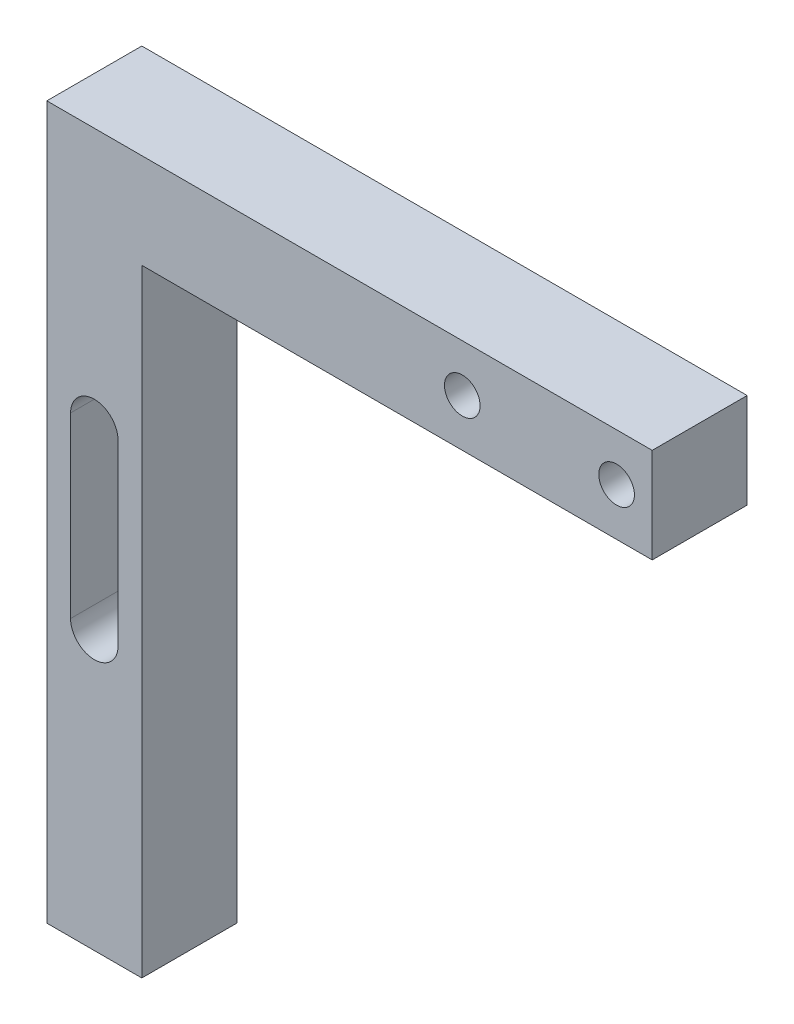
ISO-10303-21;
HEADER;
FILE_DESCRIPTION(('STEP AP214'),'2;1');
FILE_NAME('part.step','',(''),(''),'','','');
FILE_SCHEMA(('AUTOMOTIVE_DESIGN { 1 0 10303 214 1 1 1 1 }'));
ENDSEC;
DATA;
#1=APPLICATION_CONTEXT('core data for automotive mechanical design processes');
#2=APPLICATION_PROTOCOL_DEFINITION('international standard','automotive_design',2000,#1);
#3=PRODUCT_CONTEXT('',#1,'mechanical');
#4=PRODUCT('Part','Part','',(#3));
#5=PRODUCT_RELATED_PRODUCT_CATEGORY('part','',(#4));
#6=PRODUCT_DEFINITION_FORMATION('','',#4);
#7=PRODUCT_DEFINITION_CONTEXT('part definition',#1,'design');
#8=PRODUCT_DEFINITION('design','',#6,#7);
#9=PRODUCT_DEFINITION_SHAPE('','',#8);
#10=(LENGTH_UNIT() NAMED_UNIT(*) SI_UNIT(.MILLI.,.METRE.));
#11=(NAMED_UNIT(*) PLANE_ANGLE_UNIT() SI_UNIT($,.RADIAN.));
#12=(NAMED_UNIT(*) SI_UNIT($,.STERADIAN.) SOLID_ANGLE_UNIT());
#13=UNCERTAINTY_MEASURE_WITH_UNIT(LENGTH_MEASURE(1.E-05),#10,'distance_accuracy_value','');
#14=(GEOMETRIC_REPRESENTATION_CONTEXT(3) GLOBAL_UNCERTAINTY_ASSIGNED_CONTEXT((#13)) GLOBAL_UNIT_ASSIGNED_CONTEXT((#10,
#11,#12)) REPRESENTATION_CONTEXT('',''));
#15=CARTESIAN_POINT('',(0.,0.,0.));
#16=DIRECTION('',(0.,0.,1.));
#17=DIRECTION('',(1.,0.,0.));
#18=AXIS2_PLACEMENT_3D('',#15,#16,#17);
#19=CARTESIAN_POINT('',(0.,0.,8.));
#20=DIRECTION('',(0.,0.,-1.));
#21=DIRECTION('',(-1.,0.,0.));
#22=AXIS2_PLACEMENT_3D('',#19,#20,#21);
#23=PLANE('',#22);
#24=CARTESIAN_POINT('',(35.,-4.,8.));
#25=DIRECTION('',(0.,0.,1.));
#26=DIRECTION('',(1.,0.,0.));
#27=AXIS2_PLACEMENT_3D('',#24,#25,#26);
#28=CIRCLE('',#27,1.5);
#29=CARTESIAN_POINT('',(36.5,-4.,8.));
#30=VERTEX_POINT('',#29);
#31=EDGE_CURVE('E149',#30,#30,#28,.T.);
#32=ORIENTED_EDGE('',*,*,#31,.F.);
#33=EDGE_LOOP('',(#32));
#34=FACE_BOUND('',#33,.T.);
#35=CARTESIAN_POINT('',(48.,-4.,8.));
#36=DIRECTION('',(0.,0.,1.));
#37=DIRECTION('',(1.,0.,0.));
#38=AXIS2_PLACEMENT_3D('',#35,#36,#37);
#39=CIRCLE('',#38,1.5);
#40=CARTESIAN_POINT('',(49.5,-4.,8.));
#41=VERTEX_POINT('',#40);
#42=EDGE_CURVE('E155',#41,#41,#39,.T.);
#43=ORIENTED_EDGE('',*,*,#42,.F.);
#44=EDGE_LOOP('',(#43));
#45=FACE_BOUND('',#44,.T.);
#46=DIRECTION('',(0.,-1.,0.));
#47=VECTOR('',#46,1.);
#48=CARTESIAN_POINT('',(0.,-60.,8.));
#49=LINE('',#48,#47);
#50=CARTESIAN_POINT('',(0.,0.,8.));
#51=VERTEX_POINT('',#50);
#52=CARTESIAN_POINT('',(0.,-60.,8.));
#53=VERTEX_POINT('',#52);
#54=EDGE_CURVE('E161',#51,#53,#49,.T.);
#55=ORIENTED_EDGE('',*,*,#54,.T.);
#56=DIRECTION('',(1.,0.,0.));
#57=VECTOR('',#56,1.);
#58=CARTESIAN_POINT('',(8.00000000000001,-60.,8.));
#59=LINE('',#58,#57);
#60=CARTESIAN_POINT('',(8.00000000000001,-60.,8.));
#61=VERTEX_POINT('',#60);
#62=EDGE_CURVE('E164',#53,#61,#59,.T.);
#63=ORIENTED_EDGE('',*,*,#62,.T.);
#64=DIRECTION('',(0.,1.,0.));
#65=VECTOR('',#64,1.);
#66=CARTESIAN_POINT('',(8.,-8.00000000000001,8.));
#67=LINE('',#66,#65);
#68=CARTESIAN_POINT('',(8.,-8.00000000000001,8.));
#69=VERTEX_POINT('',#68);
#70=EDGE_CURVE('E167',#61,#69,#67,.T.);
#71=ORIENTED_EDGE('',*,*,#70,.T.);
#72=DIRECTION('',(1.,0.,0.));
#73=VECTOR('',#72,1.);
#74=CARTESIAN_POINT('',(51.,-8.00000000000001,8.));
#75=LINE('',#74,#73);
#76=CARTESIAN_POINT('',(51.,-8.00000000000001,8.));
#77=VERTEX_POINT('',#76);
#78=EDGE_CURVE('E169',#69,#77,#75,.T.);
#79=ORIENTED_EDGE('',*,*,#78,.T.);
#80=DIRECTION('',(0.,1.,0.));
#81=VECTOR('',#80,1.);
#82=CARTESIAN_POINT('',(51.,0.,8.));
#83=LINE('',#82,#81);
#84=CARTESIAN_POINT('',(51.,0.,8.));
#85=VERTEX_POINT('',#84);
#86=EDGE_CURVE('E171',#77,#85,#83,.T.);
#87=ORIENTED_EDGE('',*,*,#86,.T.);
#88=DIRECTION('',(-1.,0.,0.));
#89=VECTOR('',#88,1.);
#90=CARTESIAN_POINT('',(0.,0.,8.));
#91=LINE('',#90,#89);
#92=EDGE_CURVE('E173',#85,#51,#91,.T.);
#93=ORIENTED_EDGE('',*,*,#92,.T.);
#94=EDGE_LOOP('',(#55,#63,#71,#79,#87,#93));
#95=FACE_BOUND('',#94,.T.);
#96=CARTESIAN_POINT('',(4.,-21.7713426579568,8.));
#97=DIRECTION('',(0.,0.,1.));
#98=DIRECTION('',(1.,0.,0.));
#99=AXIS2_PLACEMENT_3D('',#96,#97,#98);
#100=CIRCLE('',#99,2.00000000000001);
#101=CARTESIAN_POINT('',(6.,-21.7713426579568,8.));
#102=VERTEX_POINT('',#101);
#103=CARTESIAN_POINT('',(1.99999999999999,-21.7713426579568,8.));
#104=VERTEX_POINT('',#103);
#105=EDGE_CURVE('E111',#102,#104,#100,.T.);
#106=ORIENTED_EDGE('',*,*,#105,.F.);
#107=DIRECTION('',(0.,1.,0.));
#108=VECTOR('',#107,1.);
#109=CARTESIAN_POINT('',(6.,-21.7713426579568,8.));
#110=LINE('',#109,#108);
#111=CARTESIAN_POINT('',(6.00000000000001,-36.7713426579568,8.));
#112=VERTEX_POINT('',#111);
#113=EDGE_CURVE('E133',#112,#102,#110,.T.);
#114=ORIENTED_EDGE('',*,*,#113,.F.);
#115=CARTESIAN_POINT('',(4.,-36.7713426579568,8.));
#116=DIRECTION('',(0.,0.,1.));
#117=DIRECTION('',(1.,0.,0.));
#118=AXIS2_PLACEMENT_3D('',#115,#116,#117);
#119=CIRCLE('',#118,2.00000000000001);
#120=CARTESIAN_POINT('',(2.,-36.7713426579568,8.));
#121=VERTEX_POINT('',#120);
#122=EDGE_CURVE('E131',#121,#112,#119,.T.);
#123=ORIENTED_EDGE('',*,*,#122,.F.);
#124=DIRECTION('',(0.,-1.,0.));
#125=VECTOR('',#124,1.);
#126=CARTESIAN_POINT('',(1.99999999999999,-21.7713426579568,8.));
#127=LINE('',#126,#125);
#128=EDGE_CURVE('E119',#104,#121,#127,.T.);
#129=ORIENTED_EDGE('',*,*,#128,.F.);
#130=EDGE_LOOP('',(#106,#114,#123,#129));
#131=FACE_BOUND('',#130,.T.);
#132=ADVANCED_FACE('F34',(#34,#45,#95,#131),#23,.F.);
#133=CARTESIAN_POINT('',(0.,0.,0.));
#134=DIRECTION('',(0.,0.,-1.));
#135=DIRECTION('',(-1.,0.,0.));
#136=AXIS2_PLACEMENT_3D('',#133,#134,#135);
#137=PLANE('',#136);
#138=CARTESIAN_POINT('',(48.,-4.,0.));
#139=DIRECTION('',(0.,0.,1.));
#140=DIRECTION('',(1.,0.,0.));
#141=AXIS2_PLACEMENT_3D('',#138,#139,#140);
#142=CIRCLE('',#141,1.5);
#143=CARTESIAN_POINT('',(49.5,-4.,0.));
#144=VERTEX_POINT('',#143);
#145=EDGE_CURVE('E152',#144,#144,#142,.T.);
#146=ORIENTED_EDGE('',*,*,#145,.T.);
#147=EDGE_LOOP('',(#146));
#148=FACE_BOUND('',#147,.T.);
#149=DIRECTION('',(0.,-1.,0.));
#150=VECTOR('',#149,1.);
#151=CARTESIAN_POINT('',(0.,-60.,0.));
#152=LINE('',#151,#150);
#153=CARTESIAN_POINT('',(0.,0.,0.));
#154=VERTEX_POINT('',#153);
#155=CARTESIAN_POINT('',(0.,-60.,0.));
#156=VERTEX_POINT('',#155);
#157=EDGE_CURVE('E158',#154,#156,#152,.T.);
#158=ORIENTED_EDGE('',*,*,#157,.F.);
#159=DIRECTION('',(-1.,0.,0.));
#160=VECTOR('',#159,1.);
#161=CARTESIAN_POINT('',(0.,0.,0.));
#162=LINE('',#161,#160);
#163=CARTESIAN_POINT('',(51.,0.,0.));
#164=VERTEX_POINT('',#163);
#165=EDGE_CURVE('E165',#164,#154,#162,.T.);
#166=ORIENTED_EDGE('',*,*,#165,.F.);
#167=DIRECTION('',(0.,1.,0.));
#168=VECTOR('',#167,1.);
#169=CARTESIAN_POINT('',(51.,0.,0.));
#170=LINE('',#169,#168);
#171=CARTESIAN_POINT('',(51.,-8.00000000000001,0.));
#172=VERTEX_POINT('',#171);
#173=EDGE_CURVE('E184',#172,#164,#170,.T.);
#174=ORIENTED_EDGE('',*,*,#173,.F.);
#175=DIRECTION('',(1.,0.,0.));
#176=VECTOR('',#175,1.);
#177=CARTESIAN_POINT('',(51.,-8.00000000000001,0.));
#178=LINE('',#177,#176);
#179=CARTESIAN_POINT('',(8.,-8.00000000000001,0.));
#180=VERTEX_POINT('',#179);
#181=EDGE_CURVE('E182',#180,#172,#178,.T.);
#182=ORIENTED_EDGE('',*,*,#181,.F.);
#183=DIRECTION('',(0.,1.,0.));
#184=VECTOR('',#183,1.);
#185=CARTESIAN_POINT('',(8.,-8.00000000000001,0.));
#186=LINE('',#185,#184);
#187=CARTESIAN_POINT('',(8.00000000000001,-60.,0.));
#188=VERTEX_POINT('',#187);
#189=EDGE_CURVE('E180',#188,#180,#186,.T.);
#190=ORIENTED_EDGE('',*,*,#189,.F.);
#191=DIRECTION('',(1.,0.,0.));
#192=VECTOR('',#191,1.);
#193=CARTESIAN_POINT('',(8.00000000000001,-60.,0.));
#194=LINE('',#193,#192);
#195=EDGE_CURVE('E178',#156,#188,#194,.T.);
#196=ORIENTED_EDGE('',*,*,#195,.F.);
#197=EDGE_LOOP('',(#158,#166,#174,#182,#190,#196));
#198=FACE_BOUND('',#197,.T.);
#199=CARTESIAN_POINT('',(35.,-4.,0.));
#200=DIRECTION('',(0.,0.,1.));
#201=DIRECTION('',(1.,0.,0.));
#202=AXIS2_PLACEMENT_3D('',#199,#200,#201);
#203=CIRCLE('',#202,1.5);
#204=CARTESIAN_POINT('',(36.5,-4.,0.));
#205=VERTEX_POINT('',#204);
#206=EDGE_CURVE('E127',#205,#205,#203,.T.);
#207=ORIENTED_EDGE('',*,*,#206,.T.);
#208=EDGE_LOOP('',(#207));
#209=FACE_BOUND('',#208,.T.);
#210=DIRECTION('',(0.,1.,0.));
#211=VECTOR('',#210,1.);
#212=CARTESIAN_POINT('',(6.,-21.7713426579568,0.));
#213=LINE('',#212,#211);
#214=CARTESIAN_POINT('',(6.00000000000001,-36.7713426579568,0.));
#215=VERTEX_POINT('',#214);
#216=CARTESIAN_POINT('',(6.,-21.7713426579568,0.));
#217=VERTEX_POINT('',#216);
#218=EDGE_CURVE('E120',#215,#217,#213,.T.);
#219=ORIENTED_EDGE('',*,*,#218,.T.);
#220=CARTESIAN_POINT('',(4.,-21.7713426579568,0.));
#221=DIRECTION('',(0.,0.,1.));
#222=DIRECTION('',(1.,0.,0.));
#223=AXIS2_PLACEMENT_3D('',#220,#221,#222);
#224=CIRCLE('',#223,2.00000000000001);
#225=CARTESIAN_POINT('',(1.99999999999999,-21.7713426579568,0.));
#226=VERTEX_POINT('',#225);
#227=EDGE_CURVE('E57',#217,#226,#224,.T.);
#228=ORIENTED_EDGE('',*,*,#227,.T.);
#229=DIRECTION('',(0.,-1.,0.));
#230=VECTOR('',#229,1.);
#231=CARTESIAN_POINT('',(1.99999999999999,-21.7713426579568,0.));
#232=LINE('',#231,#230);
#233=CARTESIAN_POINT('',(2.,-36.7713426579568,0.));
#234=VERTEX_POINT('',#233);
#235=EDGE_CURVE('E126',#226,#234,#232,.T.);
#236=ORIENTED_EDGE('',*,*,#235,.T.);
#237=CARTESIAN_POINT('',(4.,-36.7713426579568,0.));
#238=DIRECTION('',(0.,0.,1.));
#239=DIRECTION('',(1.,0.,0.));
#240=AXIS2_PLACEMENT_3D('',#237,#238,#239);
#241=CIRCLE('',#240,2.00000000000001);
#242=EDGE_CURVE('E141',#234,#215,#241,.T.);
#243=ORIENTED_EDGE('',*,*,#242,.T.);
#244=EDGE_LOOP('',(#219,#228,#236,#243));
#245=FACE_BOUND('',#244,.T.);
#246=ADVANCED_FACE('F208',(#148,#198,#209,#245),#137,.T.);
#247=CARTESIAN_POINT('',(0.,-60.,8.));
#248=DIRECTION('',(1.,0.,0.));
#249=DIRECTION('',(0.,0.,-1.));
#250=AXIS2_PLACEMENT_3D('',#247,#248,#249);
#251=PLANE('',#250);
#252=ORIENTED_EDGE('',*,*,#157,.T.);
#253=DIRECTION('',(0.,0.,-1.));
#254=VECTOR('',#253,1.);
#255=CARTESIAN_POINT('',(0.,-60.,8.));
#256=LINE('',#255,#254);
#257=EDGE_CURVE('E11',#53,#156,#256,.T.);
#258=ORIENTED_EDGE('',*,*,#257,.F.);
#259=ORIENTED_EDGE('',*,*,#54,.F.);
#260=DIRECTION('',(0.,0.,-1.));
#261=VECTOR('',#260,1.);
#262=CARTESIAN_POINT('',(0.,0.,8.));
#263=LINE('',#262,#261);
#264=EDGE_CURVE('E175',#51,#154,#263,.T.);
#265=ORIENTED_EDGE('',*,*,#264,.T.);
#266=EDGE_LOOP('',(#252,#258,#259,#265));
#267=FACE_BOUND('',#266,.T.);
#268=ADVANCED_FACE('F36',(#267),#251,.F.);
#269=CARTESIAN_POINT('',(8.00000000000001,-60.,8.));
#270=DIRECTION('',(0.,1.,0.));
#271=DIRECTION('',(0.,0.,1.));
#272=AXIS2_PLACEMENT_3D('',#269,#270,#271);
#273=PLANE('',#272);
#274=CARTESIAN_POINT('',(4.,-60.,4.));
#275=DIRECTION('',(0.,-1.,0.));
#276=DIRECTION('',(0.,0.,-1.));
#277=AXIS2_PLACEMENT_3D('',#274,#275,#276);
#278=CIRCLE('',#277,1.5);
#279=CARTESIAN_POINT('',(4.,-60.,2.5));
#280=VERTEX_POINT('',#279);
#281=EDGE_CURVE('E276',#280,#280,#278,.T.);
#282=ORIENTED_EDGE('',*,*,#281,.F.);
#283=EDGE_LOOP('',(#282));
#284=FACE_BOUND('',#283,.T.);
#285=ORIENTED_EDGE('',*,*,#195,.T.);
#286=DIRECTION('',(0.,0.,-1.));
#287=VECTOR('',#286,1.);
#288=CARTESIAN_POINT('',(8.00000000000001,-60.,8.));
#289=LINE('',#288,#287);
#290=EDGE_CURVE('E42',#61,#188,#289,.T.);
#291=ORIENTED_EDGE('',*,*,#290,.F.);
#292=ORIENTED_EDGE('',*,*,#62,.F.);
#293=ORIENTED_EDGE('',*,*,#257,.T.);
#294=EDGE_LOOP('',(#285,#291,#292,#293));
#295=FACE_BOUND('',#294,.T.);
#296=ADVANCED_FACE('F225',(#284,#295),#273,.F.);
#297=CARTESIAN_POINT('',(8.,-8.00000000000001,8.));
#298=DIRECTION('',(-1.,0.,0.));
#299=DIRECTION('',(0.,-1.,0.));
#300=AXIS2_PLACEMENT_3D('',#297,#298,#299);
#301=PLANE('',#300);
#302=ORIENTED_EDGE('',*,*,#189,.T.);
#303=DIRECTION('',(0.,0.,-1.));
#304=VECTOR('',#303,1.);
#305=CARTESIAN_POINT('',(8.,-8.00000000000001,8.));
#306=LINE('',#305,#304);
#307=EDGE_CURVE('E195',#69,#180,#306,.T.);
#308=ORIENTED_EDGE('',*,*,#307,.F.);
#309=ORIENTED_EDGE('',*,*,#70,.F.);
#310=ORIENTED_EDGE('',*,*,#290,.T.);
#311=EDGE_LOOP('',(#302,#308,#309,#310));
#312=FACE_BOUND('',#311,.T.);
#313=ADVANCED_FACE('F202',(#312),#301,.F.);
#314=CARTESIAN_POINT('',(51.,-8.00000000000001,8.));
#315=DIRECTION('',(0.,1.,0.));
#316=DIRECTION('',(-1.,0.,0.));
#317=AXIS2_PLACEMENT_3D('',#314,#315,#316);
#318=PLANE('',#317);
#319=ORIENTED_EDGE('',*,*,#181,.T.);
#320=DIRECTION('',(0.,0.,-1.));
#321=VECTOR('',#320,1.);
#322=CARTESIAN_POINT('',(51.,-8.00000000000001,8.));
#323=LINE('',#322,#321);
#324=EDGE_CURVE('E192',#77,#172,#323,.T.);
#325=ORIENTED_EDGE('',*,*,#324,.F.);
#326=ORIENTED_EDGE('',*,*,#78,.F.);
#327=ORIENTED_EDGE('',*,*,#307,.T.);
#328=EDGE_LOOP('',(#319,#325,#326,#327));
#329=FACE_BOUND('',#328,.T.);
#330=ADVANCED_FACE('F214',(#329),#318,.F.);
#331=CARTESIAN_POINT('',(51.,0.,8.));
#332=DIRECTION('',(-1.,0.,0.));
#333=DIRECTION('',(0.,0.,1.));
#334=AXIS2_PLACEMENT_3D('',#331,#332,#333);
#335=PLANE('',#334);
#336=ORIENTED_EDGE('',*,*,#173,.T.);
#337=DIRECTION('',(0.,0.,-1.));
#338=VECTOR('',#337,1.);
#339=CARTESIAN_POINT('',(51.,0.,8.));
#340=LINE('',#339,#338);
#341=EDGE_CURVE('E189',#85,#164,#340,.T.);
#342=ORIENTED_EDGE('',*,*,#341,.F.);
#343=ORIENTED_EDGE('',*,*,#86,.F.);
#344=ORIENTED_EDGE('',*,*,#324,.T.);
#345=EDGE_LOOP('',(#336,#342,#343,#344));
#346=FACE_BOUND('',#345,.T.);
#347=ADVANCED_FACE('F218',(#346),#335,.F.);
#348=CARTESIAN_POINT('',(0.,0.,8.));
#349=DIRECTION('',(0.,-1.,0.));
#350=DIRECTION('',(0.,0.,-1.));
#351=AXIS2_PLACEMENT_3D('',#348,#349,#350);
#352=PLANE('',#351);
#353=ORIENTED_EDGE('',*,*,#165,.T.);
#354=ORIENTED_EDGE('',*,*,#264,.F.);
#355=ORIENTED_EDGE('',*,*,#92,.F.);
#356=ORIENTED_EDGE('',*,*,#341,.T.);
#357=EDGE_LOOP('',(#353,#354,#355,#356));
#358=FACE_BOUND('',#357,.T.);
#359=ADVANCED_FACE('F228',(#358),#352,.F.);
#360=CARTESIAN_POINT('',(48.,-4.,8.));
#361=DIRECTION('',(0.,0.,-1.));
#362=DIRECTION('',(-1.,0.,0.));
#363=AXIS2_PLACEMENT_3D('',#360,#361,#362);
#364=CYLINDRICAL_SURFACE('',#363,1.5);
#365=ORIENTED_EDGE('',*,*,#42,.T.);
#366=EDGE_LOOP('',(#365));
#367=FACE_BOUND('',#366,.T.);
#368=ORIENTED_EDGE('',*,*,#145,.F.);
#369=EDGE_LOOP('',(#368));
#370=FACE_BOUND('',#369,.T.);
#371=ADVANCED_FACE('F230',(#367,#370),#364,.F.);
#372=CARTESIAN_POINT('',(35.,-4.,8.));
#373=DIRECTION('',(0.,0.,-1.));
#374=DIRECTION('',(-1.,0.,0.));
#375=AXIS2_PLACEMENT_3D('',#372,#373,#374);
#376=CYLINDRICAL_SURFACE('',#375,1.5);
#377=ORIENTED_EDGE('',*,*,#31,.T.);
#378=EDGE_LOOP('',(#377));
#379=FACE_BOUND('',#378,.T.);
#380=ORIENTED_EDGE('',*,*,#206,.F.);
#381=EDGE_LOOP('',(#380));
#382=FACE_BOUND('',#381,.T.);
#383=ADVANCED_FACE('F236',(#379,#382),#376,.F.);
#384=CARTESIAN_POINT('',(4.,-21.7713426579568,8.));
#385=DIRECTION('',(0.,0.,-1.));
#386=DIRECTION('',(-1.,0.,0.));
#387=AXIS2_PLACEMENT_3D('',#384,#385,#386);
#388=CYLINDRICAL_SURFACE('',#387,2.00000000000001);
#389=ORIENTED_EDGE('',*,*,#227,.F.);
#390=DIRECTION('',(0.,0.,-1.));
#391=VECTOR('',#390,1.);
#392=CARTESIAN_POINT('',(6.,-21.7713426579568,8.));
#393=LINE('',#392,#391);
#394=EDGE_CURVE('E115',#102,#217,#393,.T.);
#395=ORIENTED_EDGE('',*,*,#394,.F.);
#396=ORIENTED_EDGE('',*,*,#105,.T.);
#397=DIRECTION('',(0.,0.,-1.));
#398=VECTOR('',#397,1.);
#399=CARTESIAN_POINT('',(1.99999999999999,-21.7713426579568,8.));
#400=LINE('',#399,#398);
#401=EDGE_CURVE('E114',#104,#226,#400,.T.);
#402=ORIENTED_EDGE('',*,*,#401,.T.);
#403=EDGE_LOOP('',(#389,#395,#396,#402));
#404=FACE_BOUND('',#403,.T.);
#405=ADVANCED_FACE('F113',(#404),#388,.F.);
#406=CARTESIAN_POINT('',(1.99999999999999,-21.7713426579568,8.));
#407=DIRECTION('',(1.,0.,0.));
#408=DIRECTION('',(0.,1.,0.));
#409=AXIS2_PLACEMENT_3D('',#406,#407,#408);
#410=PLANE('',#409);
#411=ORIENTED_EDGE('',*,*,#235,.F.);
#412=ORIENTED_EDGE('',*,*,#401,.F.);
#413=ORIENTED_EDGE('',*,*,#128,.T.);
#414=DIRECTION('',(0.,0.,-1.));
#415=VECTOR('',#414,1.);
#416=CARTESIAN_POINT('',(2.,-36.7713426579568,8.));
#417=LINE('',#416,#415);
#418=EDGE_CURVE('E128',#121,#234,#417,.T.);
#419=ORIENTED_EDGE('',*,*,#418,.T.);
#420=EDGE_LOOP('',(#411,#412,#413,#419));
#421=FACE_BOUND('',#420,.T.);
#422=ADVANCED_FACE('F123',(#421),#410,.T.);
#423=CARTESIAN_POINT('',(4.,-36.7713426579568,8.));
#424=DIRECTION('',(0.,0.,-1.));
#425=DIRECTION('',(-1.,0.,0.));
#426=AXIS2_PLACEMENT_3D('',#423,#424,#425);
#427=CYLINDRICAL_SURFACE('',#426,2.00000000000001);
#428=ORIENTED_EDGE('',*,*,#242,.F.);
#429=ORIENTED_EDGE('',*,*,#418,.F.);
#430=ORIENTED_EDGE('',*,*,#122,.T.);
#431=DIRECTION('',(0.,0.,-1.));
#432=VECTOR('',#431,1.);
#433=CARTESIAN_POINT('',(6.00000000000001,-36.7713426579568,8.));
#434=LINE('',#433,#432);
#435=EDGE_CURVE('E49',#112,#215,#434,.T.);
#436=ORIENTED_EDGE('',*,*,#435,.T.);
#437=EDGE_LOOP('',(#428,#429,#430,#436));
#438=FACE_BOUND('',#437,.T.);
#439=ADVANCED_FACE('F258',(#438),#427,.F.);
#440=CARTESIAN_POINT('',(6.,-21.7713426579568,8.));
#441=DIRECTION('',(-1.,0.,0.));
#442=DIRECTION('',(0.,-1.,0.));
#443=AXIS2_PLACEMENT_3D('',#440,#441,#442);
#444=PLANE('',#443);
#445=ORIENTED_EDGE('',*,*,#218,.F.);
#446=ORIENTED_EDGE('',*,*,#435,.F.);
#447=ORIENTED_EDGE('',*,*,#113,.T.);
#448=ORIENTED_EDGE('',*,*,#394,.T.);
#449=EDGE_LOOP('',(#445,#446,#447,#448));
#450=FACE_BOUND('',#449,.T.);
#451=ADVANCED_FACE('F261',(#450),#444,.T.);
#452=CARTESIAN_POINT('',(4.,-40.,4.));
#453=DIRECTION('',(0.,-1.,0.));
#454=DIRECTION('',(0.,0.,-1.));
#455=AXIS2_PLACEMENT_3D('',#452,#453,#454);
#456=CYLINDRICAL_SURFACE('',#455,1.5);
#457=CARTESIAN_POINT('',(4.,-40.,4.));
#458=DIRECTION('',(0.,-1.,0.));
#459=DIRECTION('',(0.,0.,-1.));
#460=AXIS2_PLACEMENT_3D('',#457,#458,#459);
#461=CIRCLE('',#460,1.5);
#462=CARTESIAN_POINT('',(4.,-40.,2.5));
#463=VERTEX_POINT('',#462);
#464=EDGE_CURVE('E139',#463,#463,#461,.T.);
#465=ORIENTED_EDGE('',*,*,#464,.F.);
#466=EDGE_LOOP('',(#465));
#467=FACE_BOUND('',#466,.T.);
#468=ORIENTED_EDGE('',*,*,#281,.T.);
#469=EDGE_LOOP('',(#468));
#470=FACE_BOUND('',#469,.T.);
#471=ADVANCED_FACE('F265',(#467,#470),#456,.F.);
#472=CARTESIAN_POINT('',(4.,-40.,4.));
#473=DIRECTION('',(0.,-1.,0.));
#474=DIRECTION('',(0.,0.,-1.));
#475=AXIS2_PLACEMENT_3D('',#472,#473,#474);
#476=PLANE('',#475);
#477=ORIENTED_EDGE('',*,*,#464,.T.);
#478=EDGE_LOOP('',(#477));
#479=FACE_BOUND('',#478,.T.);
#480=ADVANCED_FACE('F268',(#479),#476,.T.);
#481=CLOSED_SHELL('',(#132,#246,#268,#296,#313,#330,#347,#359,#371,#383,#405,#422,#439,#451,
#471,#480));
#482=MANIFOLD_SOLID_BREP('B2',#481);
#483=ADVANCED_BREP_SHAPE_REPRESENTATION('',(#18,#482),#14);
#484=SHAPE_DEFINITION_REPRESENTATION(#9,#483);
ENDSEC;
END-ISO-10303-21;
